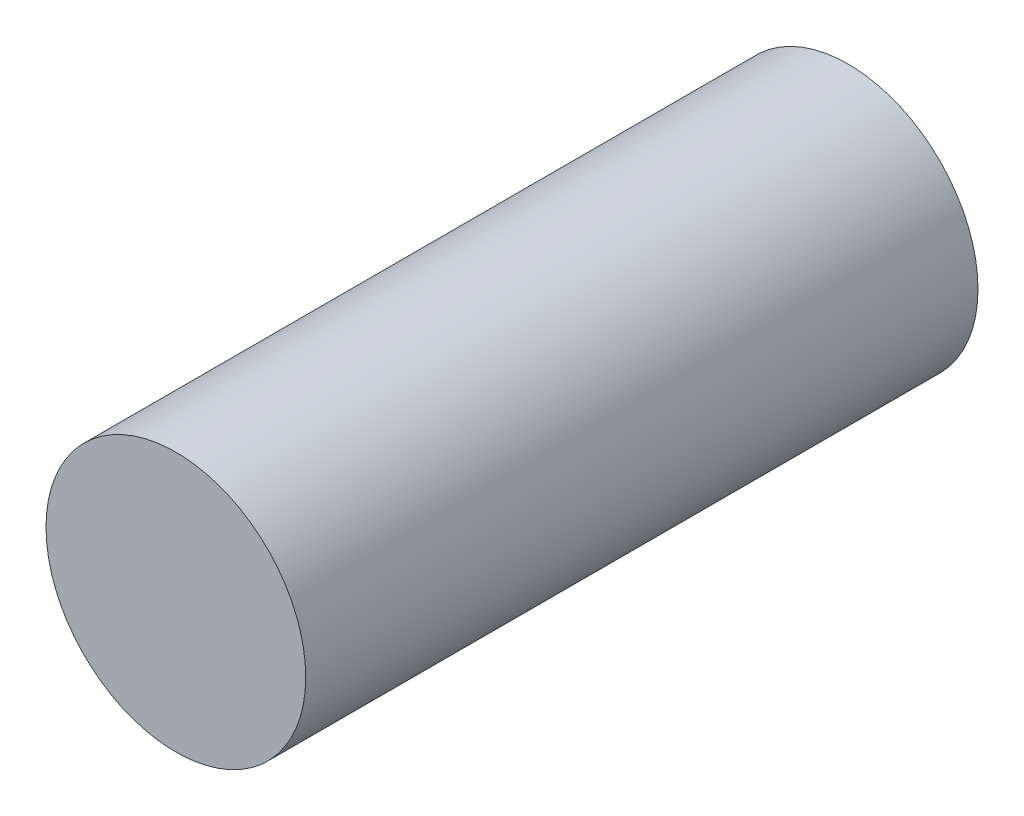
ISO-10303-21;
HEADER;
FILE_DESCRIPTION(('STEP AP214'),'2;1');
FILE_NAME('part.step','',(''),(''),'','','');
FILE_SCHEMA(('AUTOMOTIVE_DESIGN { 1 0 10303 214 1 1 1 1 }'));
ENDSEC;
DATA;
#1=APPLICATION_CONTEXT('core data for automotive mechanical design processes');
#2=APPLICATION_PROTOCOL_DEFINITION('international standard','automotive_design',2000,#1);
#3=PRODUCT_CONTEXT('',#1,'mechanical');
#4=PRODUCT('Part','Part','',(#3));
#5=PRODUCT_RELATED_PRODUCT_CATEGORY('part','',(#4));
#6=PRODUCT_DEFINITION_FORMATION('','',#4);
#7=PRODUCT_DEFINITION_CONTEXT('part definition',#1,'design');
#8=PRODUCT_DEFINITION('design','',#6,#7);
#9=PRODUCT_DEFINITION_SHAPE('','',#8);
#10=(LENGTH_UNIT() NAMED_UNIT(*) SI_UNIT(.MILLI.,.METRE.));
#11=(NAMED_UNIT(*) PLANE_ANGLE_UNIT() SI_UNIT($,.RADIAN.));
#12=(NAMED_UNIT(*) SI_UNIT($,.STERADIAN.) SOLID_ANGLE_UNIT());
#13=UNCERTAINTY_MEASURE_WITH_UNIT(LENGTH_MEASURE(1.E-05),#10,'distance_accuracy_value','');
#14=(GEOMETRIC_REPRESENTATION_CONTEXT(3) GLOBAL_UNCERTAINTY_ASSIGNED_CONTEXT((#13)) GLOBAL_UNIT_ASSIGNED_CONTEXT((#10,
#11,#12)) REPRESENTATION_CONTEXT('',''));
#15=CARTESIAN_POINT('',(0.,0.,0.));
#16=DIRECTION('',(0.,0.,1.));
#17=DIRECTION('',(1.,0.,0.));
#18=AXIS2_PLACEMENT_3D('',#15,#16,#17);
#19=CARTESIAN_POINT('',(0.,0.,200.));
#20=DIRECTION('',(0.,0.,1.));
#21=DIRECTION('',(1.,0.,0.));
#22=AXIS2_PLACEMENT_3D('',#19,#20,#21);
#23=CYLINDRICAL_SURFACE('',#22,42.5);
#24=CARTESIAN_POINT('',(0.,0.,630.));
#25=DIRECTION('',(0.,0.,1.));
#26=DIRECTION('',(1.,0.,0.));
#27=AXIS2_PLACEMENT_3D('',#24,#25,#26);
#28=CIRCLE('',#27,42.5);
#29=CARTESIAN_POINT('',(42.5000000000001,0.,630.));
#30=VERTEX_POINT('',#29);
#31=EDGE_CURVE('E16',#30,#30,#28,.T.);
#32=ORIENTED_EDGE('',*,*,#31,.T.);
#33=EDGE_LOOP('',(#32));
#34=FACE_BOUND('',#33,.T.);
#35=CARTESIAN_POINT('',(0.,0.,850.));
#36=DIRECTION('',(0.,0.,-1.));
#37=DIRECTION('',(-1.,0.,0.));
#38=AXIS2_PLACEMENT_3D('',#35,#36,#37);
#39=CIRCLE('',#38,42.5);
#40=CARTESIAN_POINT('',(-42.4999999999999,0.,850.));
#41=VERTEX_POINT('',#40);
#42=EDGE_CURVE('E9',#41,#41,#39,.T.);
#43=ORIENTED_EDGE('',*,*,#42,.T.);
#44=EDGE_LOOP('',(#43));
#45=FACE_BOUND('',#44,.T.);
#46=ADVANCED_FACE('F13',(#34,#45),#23,.T.);
#47=CARTESIAN_POINT('',(0.,0.,850.));
#48=DIRECTION('',(0.,0.,-1.));
#49=DIRECTION('',(-1.,0.,0.));
#50=AXIS2_PLACEMENT_3D('',#47,#48,#49);
#51=PLANE('',#50);
#52=ORIENTED_EDGE('',*,*,#42,.F.);
#53=EDGE_LOOP('',(#52));
#54=FACE_BOUND('',#53,.T.);
#55=ADVANCED_FACE('F28',(#54),#51,.F.);
#56=CARTESIAN_POINT('',(-570.423917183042,-363.733394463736,630.));
#57=DIRECTION('',(0.,0.,1.));
#58=DIRECTION('',(1.,0.,0.));
#59=AXIS2_PLACEMENT_3D('',#56,#57,#58);
#60=PLANE('',#59);
#61=ORIENTED_EDGE('',*,*,#31,.F.);
#62=EDGE_LOOP('',(#61));
#63=FACE_BOUND('',#62,.T.);
#64=ADVANCED_FACE('F26',(#63),#60,.F.);
#65=CLOSED_SHELL('',(#46,#55,#64));
#66=MANIFOLD_SOLID_BREP('B1',#65);
#67=ADVANCED_BREP_SHAPE_REPRESENTATION('',(#18,#66),#14);
#68=SHAPE_DEFINITION_REPRESENTATION(#9,#67);
ENDSEC;
END-ISO-10303-21;
